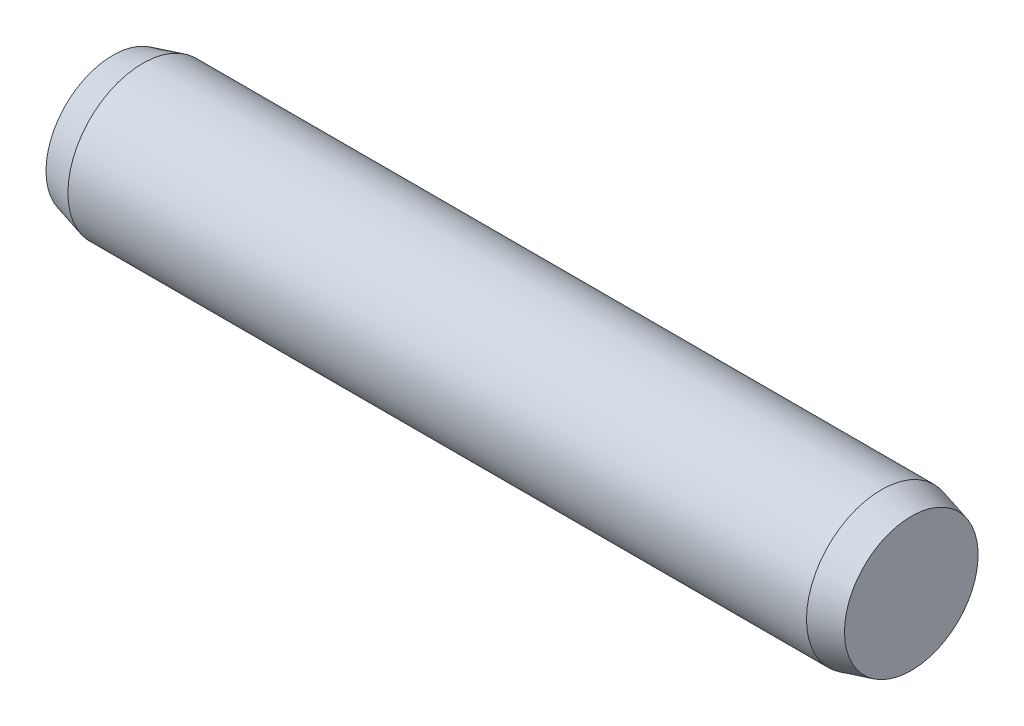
ISO-10303-21;
HEADER;
FILE_DESCRIPTION(('STEP AP214'),'2;1');
FILE_NAME('part.step','',(''),(''),'','','');
FILE_SCHEMA(('AUTOMOTIVE_DESIGN { 1 0 10303 214 1 1 1 1 }'));
ENDSEC;
DATA;
#1=APPLICATION_CONTEXT('core data for automotive mechanical design processes');
#2=APPLICATION_PROTOCOL_DEFINITION('international standard','automotive_design',2000,#1);
#3=PRODUCT_CONTEXT('',#1,'mechanical');
#4=PRODUCT('Part','Part','',(#3));
#5=PRODUCT_RELATED_PRODUCT_CATEGORY('part','',(#4));
#6=PRODUCT_DEFINITION_FORMATION('','',#4);
#7=PRODUCT_DEFINITION_CONTEXT('part definition',#1,'design');
#8=PRODUCT_DEFINITION('design','',#6,#7);
#9=PRODUCT_DEFINITION_SHAPE('','',#8);
#10=(LENGTH_UNIT() NAMED_UNIT(*) SI_UNIT(.MILLI.,.METRE.));
#11=(NAMED_UNIT(*) PLANE_ANGLE_UNIT() SI_UNIT($,.RADIAN.));
#12=(NAMED_UNIT(*) SI_UNIT($,.STERADIAN.) SOLID_ANGLE_UNIT());
#13=UNCERTAINTY_MEASURE_WITH_UNIT(LENGTH_MEASURE(1.E-05),#10,'distance_accuracy_value','');
#14=(GEOMETRIC_REPRESENTATION_CONTEXT(3) GLOBAL_UNCERTAINTY_ASSIGNED_CONTEXT((#13)) GLOBAL_UNIT_ASSIGNED_CONTEXT((#10,
#11,#12)) REPRESENTATION_CONTEXT('',''));
#15=CARTESIAN_POINT('',(0.,0.,0.));
#16=DIRECTION('',(0.,0.,1.));
#17=DIRECTION('',(1.,0.,0.));
#18=AXIS2_PLACEMENT_3D('',#15,#16,#17);
#19=CARTESIAN_POINT('',(0.,2.67846096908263,0.));
#20=DIRECTION('',(1.,0.,0.));
#21=DIRECTION('',(0.,0.,-1.));
#22=AXIS2_PLACEMENT_3D('',#19,#20,#21);
#23=PLANE('',#22);
#24=CARTESIAN_POINT('',(0.,0.,0.));
#25=DIRECTION('',(-1.,0.,0.));
#26=DIRECTION('',(0.,0.,1.));
#27=AXIS2_PLACEMENT_3D('',#24,#25,#26);
#28=CIRCLE('',#27,2.67846096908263);
#29=CARTESIAN_POINT('',(0.,0.,2.67846096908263));
#30=VERTEX_POINT('',#29);
#31=EDGE_CURVE('E45',#30,#30,#28,.T.);
#32=ORIENTED_EDGE('',*,*,#31,.T.);
#33=EDGE_LOOP('',(#32));
#34=FACE_BOUND('',#33,.T.);
#35=ADVANCED_FACE('F31',(#34),#23,.F.);
#36=CARTESIAN_POINT('',(32.,0.,0.));
#37=DIRECTION('',(-1.,0.,0.));
#38=DIRECTION('',(0.,0.,1.));
#39=AXIS2_PLACEMENT_3D('',#36,#37,#38);
#40=PLANE('',#39);
#41=CARTESIAN_POINT('',(32.,0.,0.));
#42=DIRECTION('',(-1.,0.,0.));
#43=DIRECTION('',(0.,0.,1.));
#44=AXIS2_PLACEMENT_3D('',#41,#42,#43);
#45=CIRCLE('',#44,2.67846096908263);
#46=CARTESIAN_POINT('',(32.,0.,2.67846096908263));
#47=VERTEX_POINT('',#46);
#48=EDGE_CURVE('E10',#47,#47,#45,.T.);
#49=ORIENTED_EDGE('',*,*,#48,.F.);
#50=EDGE_LOOP('',(#49));
#51=FACE_BOUND('',#50,.T.);
#52=ADVANCED_FACE('F65',(#51),#40,.F.);
#53=CARTESIAN_POINT('',(32.,0.,0.));
#54=DIRECTION('',(-1.,0.,0.));
#55=DIRECTION('',(0.,0.,1.));
#56=AXIS2_PLACEMENT_3D('',#53,#54,#55);
#57=CONICAL_SURFACE('',#56,2.67846096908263,0.261799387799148);
#58=CARTESIAN_POINT('',(30.8,0.,0.));
#59=DIRECTION('',(-1.,0.,0.));
#60=DIRECTION('',(0.,0.,1.));
#61=AXIS2_PLACEMENT_3D('',#58,#59,#60);
#62=CIRCLE('',#61,2.99999999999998);
#63=CARTESIAN_POINT('',(30.8,0.,2.99999999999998));
#64=VERTEX_POINT('',#63);
#65=EDGE_CURVE('E37',#64,#64,#62,.T.);
#66=ORIENTED_EDGE('',*,*,#65,.F.);
#67=EDGE_LOOP('',(#66));
#68=FACE_BOUND('',#67,.T.);
#69=ORIENTED_EDGE('',*,*,#48,.T.);
#70=EDGE_LOOP('',(#69));
#71=FACE_BOUND('',#70,.T.);
#72=ADVANCED_FACE('F60',(#68,#71),#57,.T.);
#73=CARTESIAN_POINT('',(-6.35,0.,0.));
#74=DIRECTION('',(-1.,0.,0.));
#75=DIRECTION('',(0.,0.,1.));
#76=AXIS2_PLACEMENT_3D('',#73,#74,#75);
#77=CYLINDRICAL_SURFACE('',#76,2.99999999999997);
#78=CARTESIAN_POINT('',(1.2,0.,0.));
#79=DIRECTION('',(-1.,0.,0.));
#80=DIRECTION('',(0.,0.,1.));
#81=AXIS2_PLACEMENT_3D('',#78,#79,#80);
#82=CIRCLE('',#81,2.99999999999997);
#83=CARTESIAN_POINT('',(1.2,0.,2.99999999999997));
#84=VERTEX_POINT('',#83);
#85=EDGE_CURVE('E41',#84,#84,#82,.T.);
#86=ORIENTED_EDGE('',*,*,#85,.F.);
#87=EDGE_LOOP('',(#86));
#88=FACE_BOUND('',#87,.T.);
#89=ORIENTED_EDGE('',*,*,#65,.T.);
#90=EDGE_LOOP('',(#89));
#91=FACE_BOUND('',#90,.T.);
#92=ADVANCED_FACE('F55',(#88,#91),#77,.T.);
#93=CARTESIAN_POINT('',(1.2,0.,0.));
#94=DIRECTION('',(1.,0.,0.));
#95=DIRECTION('',(0.,0.,-1.));
#96=AXIS2_PLACEMENT_3D('',#93,#94,#95);
#97=CONICAL_SURFACE('',#96,2.99999999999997,0.261799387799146);
#98=ORIENTED_EDGE('',*,*,#31,.F.);
#99=EDGE_LOOP('',(#98));
#100=FACE_BOUND('',#99,.T.);
#101=ORIENTED_EDGE('',*,*,#85,.T.);
#102=EDGE_LOOP('',(#101));
#103=FACE_BOUND('',#102,.T.);
#104=ADVANCED_FACE('F52',(#100,#103),#97,.T.);
#105=CLOSED_SHELL('',(#35,#52,#72,#92,#104));
#106=MANIFOLD_SOLID_BREP('B2',#105);
#107=ADVANCED_BREP_SHAPE_REPRESENTATION('',(#18,#106),#14);
#108=SHAPE_DEFINITION_REPRESENTATION(#9,#107);
ENDSEC;
END-ISO-10303-21;
